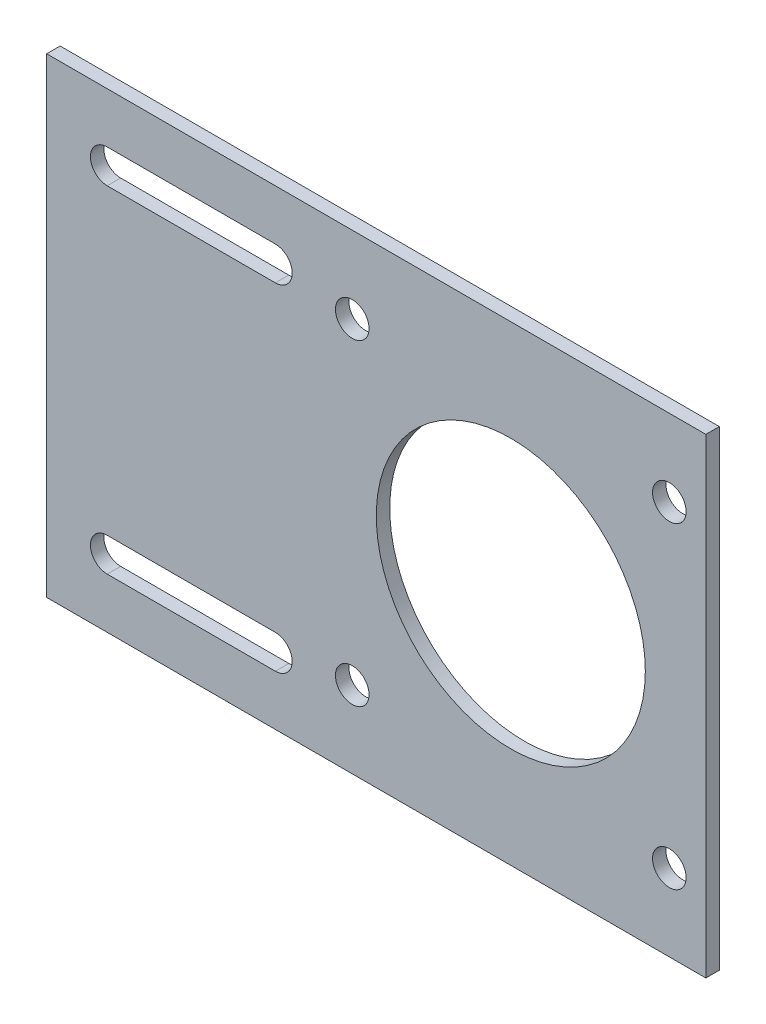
ISO-10303-21;
HEADER;
FILE_DESCRIPTION(('STEP AP214'),'2;1');
FILE_NAME('part.step','',(''),(''),'','','');
FILE_SCHEMA(('AUTOMOTIVE_DESIGN { 1 0 10303 214 1 1 1 1 }'));
ENDSEC;
DATA;
#1=APPLICATION_CONTEXT('core data for automotive mechanical design processes');
#2=APPLICATION_PROTOCOL_DEFINITION('international standard','automotive_design',2000,#1);
#3=PRODUCT_CONTEXT('',#1,'mechanical');
#4=PRODUCT('Part','Part','',(#3));
#5=PRODUCT_RELATED_PRODUCT_CATEGORY('part','',(#4));
#6=PRODUCT_DEFINITION_FORMATION('','',#4);
#7=PRODUCT_DEFINITION_CONTEXT('part definition',#1,'design');
#8=PRODUCT_DEFINITION('design','',#6,#7);
#9=PRODUCT_DEFINITION_SHAPE('','',#8);
#10=(LENGTH_UNIT() NAMED_UNIT(*) SI_UNIT(.MILLI.,.METRE.));
#11=(NAMED_UNIT(*) PLANE_ANGLE_UNIT() SI_UNIT($,.RADIAN.));
#12=(NAMED_UNIT(*) SI_UNIT($,.STERADIAN.) SOLID_ANGLE_UNIT());
#13=UNCERTAINTY_MEASURE_WITH_UNIT(LENGTH_MEASURE(1.E-05),#10,'distance_accuracy_value','');
#14=(GEOMETRIC_REPRESENTATION_CONTEXT(3) GLOBAL_UNCERTAINTY_ASSIGNED_CONTEXT((#13)) GLOBAL_UNIT_ASSIGNED_CONTEXT((#10,
#11,#12)) REPRESENTATION_CONTEXT('',''));
#15=CARTESIAN_POINT('',(0.,0.,0.));
#16=DIRECTION('',(0.,0.,1.));
#17=DIRECTION('',(1.,0.,0.));
#18=AXIS2_PLACEMENT_3D('',#15,#16,#17);
#19=CARTESIAN_POINT('',(-69.,-35.,2.));
#20=DIRECTION('',(0.,0.,1.));
#21=DIRECTION('',(1.,0.,0.));
#22=AXIS2_PLACEMENT_3D('',#19,#20,#21);
#23=PLANE('',#22);
#24=CARTESIAN_POINT('',(23.57,23.57,2.));
#25=DIRECTION('',(0.,0.,1.));
#26=DIRECTION('',(1.,0.,0.));
#27=AXIS2_PLACEMENT_3D('',#24,#25,#26);
#28=CIRCLE('',#27,2.5);
#29=CARTESIAN_POINT('',(26.07,23.57,2.));
#30=VERTEX_POINT('',#29);
#31=EDGE_CURVE('E403',#30,#30,#28,.T.);
#32=ORIENTED_EDGE('',*,*,#31,.F.);
#33=EDGE_LOOP('',(#32));
#34=FACE_BOUND('',#33,.T.);
#35=CARTESIAN_POINT('',(-23.57,23.57,2.));
#36=DIRECTION('',(0.,0.,1.));
#37=DIRECTION('',(1.,0.,0.));
#38=AXIS2_PLACEMENT_3D('',#35,#36,#37);
#39=CIRCLE('',#38,2.5);
#40=CARTESIAN_POINT('',(-21.07,23.57,2.));
#41=VERTEX_POINT('',#40);
#42=EDGE_CURVE('E405',#41,#41,#39,.T.);
#43=ORIENTED_EDGE('',*,*,#42,.F.);
#44=EDGE_LOOP('',(#43));
#45=FACE_BOUND('',#44,.T.);
#46=CARTESIAN_POINT('',(23.57,-23.57,2.));
#47=DIRECTION('',(0.,0.,1.));
#48=DIRECTION('',(1.,0.,0.));
#49=AXIS2_PLACEMENT_3D('',#46,#47,#48);
#50=CIRCLE('',#49,2.5);
#51=CARTESIAN_POINT('',(26.07,-23.57,2.));
#52=VERTEX_POINT('',#51);
#53=EDGE_CURVE('E413',#52,#52,#50,.T.);
#54=ORIENTED_EDGE('',*,*,#53,.F.);
#55=EDGE_LOOP('',(#54));
#56=FACE_BOUND('',#55,.T.);
#57=CARTESIAN_POINT('',(-23.57,-23.57,2.));
#58=DIRECTION('',(0.,0.,1.));
#59=DIRECTION('',(1.,0.,0.));
#60=AXIS2_PLACEMENT_3D('',#57,#58,#59);
#61=CIRCLE('',#60,2.5);
#62=CARTESIAN_POINT('',(-21.07,-23.57,2.));
#63=VERTEX_POINT('',#62);
#64=EDGE_CURVE('E419',#63,#63,#61,.T.);
#65=ORIENTED_EDGE('',*,*,#64,.F.);
#66=EDGE_LOOP('',(#65));
#67=FACE_BOUND('',#66,.T.);
#68=DIRECTION('',(1.,0.,0.));
#69=VECTOR('',#68,1.);
#70=CARTESIAN_POINT('',(-60.,22.5,2.));
#71=LINE('',#70,#69);
#72=CARTESIAN_POINT('',(-60.,22.5,2.));
#73=VERTEX_POINT('',#72);
#74=CARTESIAN_POINT('',(-35.,22.5,2.));
#75=VERTEX_POINT('',#74);
#76=EDGE_CURVE('E164',#73,#75,#71,.T.);
#77=ORIENTED_EDGE('',*,*,#76,.F.);
#78=CARTESIAN_POINT('',(-60.,25.,2.));
#79=DIRECTION('',(0.,0.,1.));
#80=DIRECTION('',(1.,0.,0.));
#81=AXIS2_PLACEMENT_3D('',#78,#79,#80);
#82=CIRCLE('',#81,2.5);
#83=CARTESIAN_POINT('',(-60.,27.5,2.));
#84=VERTEX_POINT('',#83);
#85=EDGE_CURVE('E162',#84,#73,#82,.T.);
#86=ORIENTED_EDGE('',*,*,#85,.F.);
#87=DIRECTION('',(-1.,0.,0.));
#88=VECTOR('',#87,1.);
#89=CARTESIAN_POINT('',(-60.,27.5,2.));
#90=LINE('',#89,#88);
#91=CARTESIAN_POINT('',(-35.,27.5,2.));
#92=VERTEX_POINT('',#91);
#93=EDGE_CURVE('E170',#92,#84,#90,.T.);
#94=ORIENTED_EDGE('',*,*,#93,.F.);
#95=CARTESIAN_POINT('',(-35.,25.,2.));
#96=DIRECTION('',(0.,0.,1.));
#97=DIRECTION('',(-1.,0.,0.));
#98=AXIS2_PLACEMENT_3D('',#95,#96,#97);
#99=CIRCLE('',#98,2.5);
#100=EDGE_CURVE('E167',#75,#92,#99,.T.);
#101=ORIENTED_EDGE('',*,*,#100,.F.);
#102=EDGE_LOOP('',(#77,#86,#94,#101));
#103=FACE_BOUND('',#102,.T.);
#104=DIRECTION('',(0.,-1.,0.));
#105=VECTOR('',#104,1.);
#106=CARTESIAN_POINT('',(-69.,35.,2.));
#107=LINE('',#106,#105);
#108=CARTESIAN_POINT('',(-69.,35.,2.));
#109=VERTEX_POINT('',#108);
#110=CARTESIAN_POINT('',(-69.,-35.,2.));
#111=VERTEX_POINT('',#110);
#112=EDGE_CURVE('E199',#109,#111,#107,.T.);
#113=ORIENTED_EDGE('',*,*,#112,.T.);
#114=DIRECTION('',(1.,0.,0.));
#115=VECTOR('',#114,1.);
#116=CARTESIAN_POINT('',(-69.,-35.,2.));
#117=LINE('',#116,#115);
#118=CARTESIAN_POINT('',(29.,-35.,2.));
#119=VERTEX_POINT('',#118);
#120=EDGE_CURVE('E202',#111,#119,#117,.T.);
#121=ORIENTED_EDGE('',*,*,#120,.T.);
#122=DIRECTION('',(0.,1.,0.));
#123=VECTOR('',#122,1.);
#124=CARTESIAN_POINT('',(29.,35.,2.));
#125=LINE('',#124,#123);
#126=CARTESIAN_POINT('',(29.,35.,2.));
#127=VERTEX_POINT('',#126);
#128=EDGE_CURVE('E205',#119,#127,#125,.T.);
#129=ORIENTED_EDGE('',*,*,#128,.T.);
#130=DIRECTION('',(-1.,0.,0.));
#131=VECTOR('',#130,1.);
#132=CARTESIAN_POINT('',(-69.,35.,2.));
#133=LINE('',#132,#131);
#134=EDGE_CURVE('E207',#127,#109,#133,.T.);
#135=ORIENTED_EDGE('',*,*,#134,.T.);
#136=EDGE_LOOP('',(#113,#121,#129,#135));
#137=FACE_BOUND('',#136,.T.);
#138=CARTESIAN_POINT('',(0.,0.,2.));
#139=DIRECTION('',(0.,0.,1.));
#140=DIRECTION('',(1.,0.,0.));
#141=AXIS2_PLACEMENT_3D('',#138,#139,#140);
#142=CIRCLE('',#141,20.);
#143=CARTESIAN_POINT('',(20.,0.,2.));
#144=VERTEX_POINT('',#143);
#145=EDGE_CURVE('E193',#144,#144,#142,.T.);
#146=ORIENTED_EDGE('',*,*,#145,.F.);
#147=EDGE_LOOP('',(#146));
#148=FACE_BOUND('',#147,.T.);
#149=DIRECTION('',(1.,0.,0.));
#150=VECTOR('',#149,1.);
#151=CARTESIAN_POINT('',(-60.,-27.5,2.));
#152=LINE('',#151,#150);
#153=CARTESIAN_POINT('',(-60.,-27.5,2.));
#154=VERTEX_POINT('',#153);
#155=CARTESIAN_POINT('',(-35.,-27.5,2.));
#156=VERTEX_POINT('',#155);
#157=EDGE_CURVE('E132',#154,#156,#152,.T.);
#158=ORIENTED_EDGE('',*,*,#157,.F.);
#159=CARTESIAN_POINT('',(-60.,-25.,2.));
#160=DIRECTION('',(0.,0.,1.));
#161=DIRECTION('',(1.,0.,0.));
#162=AXIS2_PLACEMENT_3D('',#159,#160,#161);
#163=CIRCLE('',#162,2.5);
#164=CARTESIAN_POINT('',(-60.,-22.5,2.));
#165=VERTEX_POINT('',#164);
#166=EDGE_CURVE('E124',#165,#154,#163,.T.);
#167=ORIENTED_EDGE('',*,*,#166,.F.);
#168=DIRECTION('',(-1.,0.,0.));
#169=VECTOR('',#168,1.);
#170=CARTESIAN_POINT('',(-60.,-22.5,2.));
#171=LINE('',#170,#169);
#172=CARTESIAN_POINT('',(-35.,-22.5,2.));
#173=VERTEX_POINT('',#172);
#174=EDGE_CURVE('E146',#173,#165,#171,.T.);
#175=ORIENTED_EDGE('',*,*,#174,.F.);
#176=CARTESIAN_POINT('',(-35.,-25.,2.));
#177=DIRECTION('',(0.,0.,1.));
#178=DIRECTION('',(-1.,0.,0.));
#179=AXIS2_PLACEMENT_3D('',#176,#177,#178);
#180=CIRCLE('',#179,2.5);
#181=EDGE_CURVE('E144',#156,#173,#180,.T.);
#182=ORIENTED_EDGE('',*,*,#181,.F.);
#183=EDGE_LOOP('',(#158,#167,#175,#182));
#184=FACE_BOUND('',#183,.T.);
#185=ADVANCED_FACE('F35',(#34,#45,#56,#67,#103,#137,#148,#184),#23,.T.);
#186=CARTESIAN_POINT('',(-69.,-35.,0.));
#187=DIRECTION('',(0.,0.,1.));
#188=DIRECTION('',(1.,0.,0.));
#189=AXIS2_PLACEMENT_3D('',#186,#187,#188);
#190=PLANE('',#189);
#191=CARTESIAN_POINT('',(23.57,23.57,0.));
#192=DIRECTION('',(0.,0.,1.));
#193=DIRECTION('',(1.,0.,0.));
#194=AXIS2_PLACEMENT_3D('',#191,#192,#193);
#195=CIRCLE('',#194,2.5);
#196=CARTESIAN_POINT('',(26.07,23.57,0.));
#197=VERTEX_POINT('',#196);
#198=EDGE_CURVE('E401',#197,#197,#195,.T.);
#199=ORIENTED_EDGE('',*,*,#198,.T.);
#200=EDGE_LOOP('',(#199));
#201=FACE_BOUND('',#200,.T.);
#202=CARTESIAN_POINT('',(-23.57,23.57,0.));
#203=DIRECTION('',(0.,0.,1.));
#204=DIRECTION('',(1.,0.,0.));
#205=AXIS2_PLACEMENT_3D('',#202,#203,#204);
#206=CIRCLE('',#205,2.5);
#207=CARTESIAN_POINT('',(-21.07,23.57,0.));
#208=VERTEX_POINT('',#207);
#209=EDGE_CURVE('E410',#208,#208,#206,.T.);
#210=ORIENTED_EDGE('',*,*,#209,.T.);
#211=EDGE_LOOP('',(#210));
#212=FACE_BOUND('',#211,.T.);
#213=CARTESIAN_POINT('',(23.57,-23.57,0.));
#214=DIRECTION('',(0.,0.,1.));
#215=DIRECTION('',(1.,0.,0.));
#216=AXIS2_PLACEMENT_3D('',#213,#214,#215);
#217=CIRCLE('',#216,2.5);
#218=CARTESIAN_POINT('',(26.07,-23.57,0.));
#219=VERTEX_POINT('',#218);
#220=EDGE_CURVE('E416',#219,#219,#217,.T.);
#221=ORIENTED_EDGE('',*,*,#220,.T.);
#222=EDGE_LOOP('',(#221));
#223=FACE_BOUND('',#222,.T.);
#224=CARTESIAN_POINT('',(-23.57,-23.57,0.));
#225=DIRECTION('',(0.,0.,1.));
#226=DIRECTION('',(1.,0.,0.));
#227=AXIS2_PLACEMENT_3D('',#224,#225,#226);
#228=CIRCLE('',#227,2.5);
#229=CARTESIAN_POINT('',(-21.07,-23.57,0.));
#230=VERTEX_POINT('',#229);
#231=EDGE_CURVE('E152',#230,#230,#228,.T.);
#232=ORIENTED_EDGE('',*,*,#231,.T.);
#233=EDGE_LOOP('',(#232));
#234=FACE_BOUND('',#233,.T.);
#235=CARTESIAN_POINT('',(-60.,25.,0.));
#236=DIRECTION('',(0.,0.,1.));
#237=DIRECTION('',(1.,0.,0.));
#238=AXIS2_PLACEMENT_3D('',#235,#236,#237);
#239=CIRCLE('',#238,2.5);
#240=CARTESIAN_POINT('',(-60.,27.5,0.));
#241=VERTEX_POINT('',#240);
#242=CARTESIAN_POINT('',(-60.,22.5,0.));
#243=VERTEX_POINT('',#242);
#244=EDGE_CURVE('E140',#241,#243,#239,.T.);
#245=ORIENTED_EDGE('',*,*,#244,.T.);
#246=DIRECTION('',(1.,0.,0.));
#247=VECTOR('',#246,1.);
#248=CARTESIAN_POINT('',(-60.,22.5,0.));
#249=LINE('',#248,#247);
#250=CARTESIAN_POINT('',(-35.,22.5,0.));
#251=VERTEX_POINT('',#250);
#252=EDGE_CURVE('E175',#243,#251,#249,.T.);
#253=ORIENTED_EDGE('',*,*,#252,.T.);
#254=CARTESIAN_POINT('',(-35.,25.,0.));
#255=DIRECTION('',(0.,0.,1.));
#256=DIRECTION('',(-1.,0.,0.));
#257=AXIS2_PLACEMENT_3D('',#254,#255,#256);
#258=CIRCLE('',#257,2.5);
#259=CARTESIAN_POINT('',(-35.,27.5,0.));
#260=VERTEX_POINT('',#259);
#261=EDGE_CURVE('E178',#251,#260,#258,.T.);
#262=ORIENTED_EDGE('',*,*,#261,.T.);
#263=DIRECTION('',(-1.,0.,0.));
#264=VECTOR('',#263,1.);
#265=CARTESIAN_POINT('',(-60.,27.5,0.));
#266=LINE('',#265,#264);
#267=EDGE_CURVE('E165',#260,#241,#266,.T.);
#268=ORIENTED_EDGE('',*,*,#267,.T.);
#269=EDGE_LOOP('',(#245,#253,#262,#268));
#270=FACE_BOUND('',#269,.T.);
#271=DIRECTION('',(0.,-1.,0.));
#272=VECTOR('',#271,1.);
#273=CARTESIAN_POINT('',(-69.,35.,0.));
#274=LINE('',#273,#272);
#275=CARTESIAN_POINT('',(-69.,35.,0.));
#276=VERTEX_POINT('',#275);
#277=CARTESIAN_POINT('',(-69.,-35.,0.));
#278=VERTEX_POINT('',#277);
#279=EDGE_CURVE('E196',#276,#278,#274,.T.);
#280=ORIENTED_EDGE('',*,*,#279,.F.);
#281=DIRECTION('',(-1.,0.,0.));
#282=VECTOR('',#281,1.);
#283=CARTESIAN_POINT('',(-69.,35.,0.));
#284=LINE('',#283,#282);
#285=CARTESIAN_POINT('',(29.,35.,0.));
#286=VERTEX_POINT('',#285);
#287=EDGE_CURVE('E203',#286,#276,#284,.T.);
#288=ORIENTED_EDGE('',*,*,#287,.F.);
#289=DIRECTION('',(0.,1.,0.));
#290=VECTOR('',#289,1.);
#291=CARTESIAN_POINT('',(29.,35.,0.));
#292=LINE('',#291,#290);
#293=CARTESIAN_POINT('',(29.,-35.,0.));
#294=VERTEX_POINT('',#293);
#295=EDGE_CURVE('E214',#294,#286,#292,.T.);
#296=ORIENTED_EDGE('',*,*,#295,.F.);
#297=DIRECTION('',(1.,0.,0.));
#298=VECTOR('',#297,1.);
#299=CARTESIAN_POINT('',(-69.,-35.,0.));
#300=LINE('',#299,#298);
#301=EDGE_CURVE('E212',#278,#294,#300,.T.);
#302=ORIENTED_EDGE('',*,*,#301,.F.);
#303=EDGE_LOOP('',(#280,#288,#296,#302));
#304=FACE_BOUND('',#303,.T.);
#305=CARTESIAN_POINT('',(0.,0.,0.));
#306=DIRECTION('',(0.,0.,1.));
#307=DIRECTION('',(1.,0.,0.));
#308=AXIS2_PLACEMENT_3D('',#305,#306,#307);
#309=CIRCLE('',#308,20.);
#310=CARTESIAN_POINT('',(20.,0.,0.));
#311=VERTEX_POINT('',#310);
#312=EDGE_CURVE('E192',#311,#311,#309,.T.);
#313=ORIENTED_EDGE('',*,*,#312,.T.);
#314=EDGE_LOOP('',(#313));
#315=FACE_BOUND('',#314,.T.);
#316=CARTESIAN_POINT('',(-60.,-25.,0.));
#317=DIRECTION('',(0.,0.,1.));
#318=DIRECTION('',(1.,0.,0.));
#319=AXIS2_PLACEMENT_3D('',#316,#317,#318);
#320=CIRCLE('',#319,2.5);
#321=CARTESIAN_POINT('',(-60.,-22.5,0.));
#322=VERTEX_POINT('',#321);
#323=CARTESIAN_POINT('',(-60.,-27.5,0.));
#324=VERTEX_POINT('',#323);
#325=EDGE_CURVE('E58',#322,#324,#320,.T.);
#326=ORIENTED_EDGE('',*,*,#325,.T.);
#327=DIRECTION('',(1.,0.,0.));
#328=VECTOR('',#327,1.);
#329=CARTESIAN_POINT('',(-60.,-27.5,0.));
#330=LINE('',#329,#328);
#331=CARTESIAN_POINT('',(-35.,-27.5,0.));
#332=VERTEX_POINT('',#331);
#333=EDGE_CURVE('E139',#324,#332,#330,.T.);
#334=ORIENTED_EDGE('',*,*,#333,.T.);
#335=CARTESIAN_POINT('',(-35.,-25.,0.));
#336=DIRECTION('',(0.,0.,1.));
#337=DIRECTION('',(-1.,0.,0.));
#338=AXIS2_PLACEMENT_3D('',#335,#336,#337);
#339=CIRCLE('',#338,2.5);
#340=CARTESIAN_POINT('',(-35.,-22.5,0.));
#341=VERTEX_POINT('',#340);
#342=EDGE_CURVE('E154',#332,#341,#339,.T.);
#343=ORIENTED_EDGE('',*,*,#342,.T.);
#344=DIRECTION('',(-1.,0.,0.));
#345=VECTOR('',#344,1.);
#346=CARTESIAN_POINT('',(-60.,-22.5,0.));
#347=LINE('',#346,#345);
#348=EDGE_CURVE('E133',#341,#322,#347,.T.);
#349=ORIENTED_EDGE('',*,*,#348,.T.);
#350=EDGE_LOOP('',(#326,#334,#343,#349));
#351=FACE_BOUND('',#350,.T.);
#352=ADVANCED_FACE('F232',(#201,#212,#223,#234,#270,#304,#315,#351),#190,.F.);
#353=CARTESIAN_POINT('',(-69.,35.,2.));
#354=DIRECTION('',(1.,0.,0.));
#355=DIRECTION('',(0.,1.,0.));
#356=AXIS2_PLACEMENT_3D('',#353,#354,#355);
#357=PLANE('',#356);
#358=ORIENTED_EDGE('',*,*,#279,.T.);
#359=DIRECTION('',(0.,0.,-1.));
#360=VECTOR('',#359,1.);
#361=CARTESIAN_POINT('',(-69.,-35.,2.));
#362=LINE('',#361,#360);
#363=EDGE_CURVE('E11',#111,#278,#362,.T.);
#364=ORIENTED_EDGE('',*,*,#363,.F.);
#365=ORIENTED_EDGE('',*,*,#112,.F.);
#366=DIRECTION('',(0.,0.,-1.));
#367=VECTOR('',#366,1.);
#368=CARTESIAN_POINT('',(-69.,35.,2.));
#369=LINE('',#368,#367);
#370=EDGE_CURVE('E209',#109,#276,#369,.T.);
#371=ORIENTED_EDGE('',*,*,#370,.T.);
#372=EDGE_LOOP('',(#358,#364,#365,#371));
#373=FACE_BOUND('',#372,.T.);
#374=ADVANCED_FACE('F37',(#373),#357,.F.);
#375=CARTESIAN_POINT('',(-69.,-35.,2.));
#376=DIRECTION('',(0.,1.,0.));
#377=DIRECTION('',(0.,0.,1.));
#378=AXIS2_PLACEMENT_3D('',#375,#376,#377);
#379=PLANE('',#378);
#380=ORIENTED_EDGE('',*,*,#301,.T.);
#381=DIRECTION('',(0.,0.,-1.));
#382=VECTOR('',#381,1.);
#383=CARTESIAN_POINT('',(29.,-35.,2.));
#384=LINE('',#383,#382);
#385=EDGE_CURVE('E43',#119,#294,#384,.T.);
#386=ORIENTED_EDGE('',*,*,#385,.F.);
#387=ORIENTED_EDGE('',*,*,#120,.F.);
#388=ORIENTED_EDGE('',*,*,#363,.T.);
#389=EDGE_LOOP('',(#380,#386,#387,#388));
#390=FACE_BOUND('',#389,.T.);
#391=ADVANCED_FACE('F243',(#390),#379,.F.);
#392=CARTESIAN_POINT('',(29.,35.,2.));
#393=DIRECTION('',(-1.,0.,0.));
#394=DIRECTION('',(0.,-1.,0.));
#395=AXIS2_PLACEMENT_3D('',#392,#393,#394);
#396=PLANE('',#395);
#397=ORIENTED_EDGE('',*,*,#295,.T.);
#398=DIRECTION('',(0.,0.,-1.));
#399=VECTOR('',#398,1.);
#400=CARTESIAN_POINT('',(29.,35.,2.));
#401=LINE('',#400,#399);
#402=EDGE_CURVE('E219',#127,#286,#401,.T.);
#403=ORIENTED_EDGE('',*,*,#402,.F.);
#404=ORIENTED_EDGE('',*,*,#128,.F.);
#405=ORIENTED_EDGE('',*,*,#385,.T.);
#406=EDGE_LOOP('',(#397,#403,#404,#405));
#407=FACE_BOUND('',#406,.T.);
#408=ADVANCED_FACE('F226',(#407),#396,.F.);
#409=CARTESIAN_POINT('',(-69.,35.,2.));
#410=DIRECTION('',(0.,-1.,0.));
#411=DIRECTION('',(0.,0.,-1.));
#412=AXIS2_PLACEMENT_3D('',#409,#410,#411);
#413=PLANE('',#412);
#414=ORIENTED_EDGE('',*,*,#287,.T.);
#415=ORIENTED_EDGE('',*,*,#370,.F.);
#416=ORIENTED_EDGE('',*,*,#134,.F.);
#417=ORIENTED_EDGE('',*,*,#402,.T.);
#418=EDGE_LOOP('',(#414,#415,#416,#417));
#419=FACE_BOUND('',#418,.T.);
#420=ADVANCED_FACE('F236',(#419),#413,.F.);
#421=CARTESIAN_POINT('',(0.,0.,2.));
#422=DIRECTION('',(0.,0.,-1.));
#423=DIRECTION('',(-1.,0.,0.));
#424=AXIS2_PLACEMENT_3D('',#421,#422,#423);
#425=CYLINDRICAL_SURFACE('',#424,20.);
#426=ORIENTED_EDGE('',*,*,#145,.T.);
#427=EDGE_LOOP('',(#426));
#428=FACE_BOUND('',#427,.T.);
#429=ORIENTED_EDGE('',*,*,#312,.F.);
#430=EDGE_LOOP('',(#429));
#431=FACE_BOUND('',#430,.T.);
#432=ADVANCED_FACE('F261',(#428,#431),#425,.F.);
#433=CARTESIAN_POINT('',(-60.,25.,2.));
#434=DIRECTION('',(0.,0.,-1.));
#435=DIRECTION('',(-1.,0.,0.));
#436=AXIS2_PLACEMENT_3D('',#433,#434,#435);
#437=CYLINDRICAL_SURFACE('',#436,2.5);
#438=ORIENTED_EDGE('',*,*,#244,.F.);
#439=DIRECTION('',(0.,0.,-1.));
#440=VECTOR('',#439,1.);
#441=CARTESIAN_POINT('',(-60.,27.5,2.));
#442=LINE('',#441,#440);
#443=EDGE_CURVE('E172',#84,#241,#442,.T.);
#444=ORIENTED_EDGE('',*,*,#443,.F.);
#445=ORIENTED_EDGE('',*,*,#85,.T.);
#446=DIRECTION('',(0.,0.,-1.));
#447=VECTOR('',#446,1.);
#448=CARTESIAN_POINT('',(-60.,22.5,2.));
#449=LINE('',#448,#447);
#450=EDGE_CURVE('E189',#73,#243,#449,.T.);
#451=ORIENTED_EDGE('',*,*,#450,.T.);
#452=EDGE_LOOP('',(#438,#444,#445,#451));
#453=FACE_BOUND('',#452,.T.);
#454=ADVANCED_FACE('F268',(#453),#437,.F.);
#455=CARTESIAN_POINT('',(-60.,22.5,2.));
#456=DIRECTION('',(0.,1.,0.));
#457=DIRECTION('',(0.,0.,1.));
#458=AXIS2_PLACEMENT_3D('',#455,#456,#457);
#459=PLANE('',#458);
#460=ORIENTED_EDGE('',*,*,#252,.F.);
#461=ORIENTED_EDGE('',*,*,#450,.F.);
#462=ORIENTED_EDGE('',*,*,#76,.T.);
#463=DIRECTION('',(0.,0.,-1.));
#464=VECTOR('',#463,1.);
#465=CARTESIAN_POINT('',(-35.,22.5,2.));
#466=LINE('',#465,#464);
#467=EDGE_CURVE('E187',#75,#251,#466,.T.);
#468=ORIENTED_EDGE('',*,*,#467,.T.);
#469=EDGE_LOOP('',(#460,#461,#462,#468));
#470=FACE_BOUND('',#469,.T.);
#471=ADVANCED_FACE('F273',(#470),#459,.T.);
#472=CARTESIAN_POINT('',(-35.,25.,2.));
#473=DIRECTION('',(0.,0.,-1.));
#474=DIRECTION('',(-1.,0.,0.));
#475=AXIS2_PLACEMENT_3D('',#472,#473,#474);
#476=CYLINDRICAL_SURFACE('',#475,2.5);
#477=ORIENTED_EDGE('',*,*,#261,.F.);
#478=ORIENTED_EDGE('',*,*,#467,.F.);
#479=ORIENTED_EDGE('',*,*,#100,.T.);
#480=DIRECTION('',(0.,0.,-1.));
#481=VECTOR('',#480,1.);
#482=CARTESIAN_POINT('',(-35.,27.5,2.));
#483=LINE('',#482,#481);
#484=EDGE_CURVE('E185',#92,#260,#483,.T.);
#485=ORIENTED_EDGE('',*,*,#484,.T.);
#486=EDGE_LOOP('',(#477,#478,#479,#485));
#487=FACE_BOUND('',#486,.T.);
#488=ADVANCED_FACE('F303',(#487),#476,.F.);
#489=CARTESIAN_POINT('',(-60.,27.5,2.));
#490=DIRECTION('',(0.,-1.,0.));
#491=DIRECTION('',(0.,0.,-1.));
#492=AXIS2_PLACEMENT_3D('',#489,#490,#491);
#493=PLANE('',#492);
#494=ORIENTED_EDGE('',*,*,#267,.F.);
#495=ORIENTED_EDGE('',*,*,#484,.F.);
#496=ORIENTED_EDGE('',*,*,#93,.T.);
#497=ORIENTED_EDGE('',*,*,#443,.T.);
#498=EDGE_LOOP('',(#494,#495,#496,#497));
#499=FACE_BOUND('',#498,.T.);
#500=ADVANCED_FACE('F300',(#499),#493,.T.);
#501=CARTESIAN_POINT('',(-60.,-25.,2.));
#502=DIRECTION('',(0.,0.,-1.));
#503=DIRECTION('',(-1.,0.,0.));
#504=AXIS2_PLACEMENT_3D('',#501,#502,#503);
#505=CYLINDRICAL_SURFACE('',#504,2.5);
#506=ORIENTED_EDGE('',*,*,#325,.F.);
#507=DIRECTION('',(0.,0.,-1.));
#508=VECTOR('',#507,1.);
#509=CARTESIAN_POINT('',(-60.,-22.5,2.));
#510=LINE('',#509,#508);
#511=EDGE_CURVE('E128',#165,#322,#510,.T.);
#512=ORIENTED_EDGE('',*,*,#511,.F.);
#513=ORIENTED_EDGE('',*,*,#166,.T.);
#514=DIRECTION('',(0.,0.,-1.));
#515=VECTOR('',#514,1.);
#516=CARTESIAN_POINT('',(-60.,-27.5,2.));
#517=LINE('',#516,#515);
#518=EDGE_CURVE('E127',#154,#324,#517,.T.);
#519=ORIENTED_EDGE('',*,*,#518,.T.);
#520=EDGE_LOOP('',(#506,#512,#513,#519));
#521=FACE_BOUND('',#520,.T.);
#522=ADVANCED_FACE('F126',(#521),#505,.F.);
#523=CARTESIAN_POINT('',(-60.,-27.5,2.));
#524=DIRECTION('',(0.,1.,0.));
#525=DIRECTION('',(0.,0.,1.));
#526=AXIS2_PLACEMENT_3D('',#523,#524,#525);
#527=PLANE('',#526);
#528=ORIENTED_EDGE('',*,*,#333,.F.);
#529=ORIENTED_EDGE('',*,*,#518,.F.);
#530=ORIENTED_EDGE('',*,*,#157,.T.);
#531=DIRECTION('',(0.,0.,-1.));
#532=VECTOR('',#531,1.);
#533=CARTESIAN_POINT('',(-35.,-27.5,2.));
#534=LINE('',#533,#532);
#535=EDGE_CURVE('E141',#156,#332,#534,.T.);
#536=ORIENTED_EDGE('',*,*,#535,.T.);
#537=EDGE_LOOP('',(#528,#529,#530,#536));
#538=FACE_BOUND('',#537,.T.);
#539=ADVANCED_FACE('F136',(#538),#527,.T.);
#540=CARTESIAN_POINT('',(-35.,-25.,2.));
#541=DIRECTION('',(0.,0.,-1.));
#542=DIRECTION('',(-1.,0.,0.));
#543=AXIS2_PLACEMENT_3D('',#540,#541,#542);
#544=CYLINDRICAL_SURFACE('',#543,2.5);
#545=ORIENTED_EDGE('',*,*,#342,.F.);
#546=ORIENTED_EDGE('',*,*,#535,.F.);
#547=ORIENTED_EDGE('',*,*,#181,.T.);
#548=DIRECTION('',(0.,0.,-1.));
#549=VECTOR('',#548,1.);
#550=CARTESIAN_POINT('',(-35.,-22.5,2.));
#551=LINE('',#550,#549);
#552=EDGE_CURVE('E50',#173,#341,#551,.T.);
#553=ORIENTED_EDGE('',*,*,#552,.T.);
#554=EDGE_LOOP('',(#545,#546,#547,#553));
#555=FACE_BOUND('',#554,.T.);
#556=ADVANCED_FACE('F283',(#555),#544,.F.);
#557=CARTESIAN_POINT('',(-60.,-22.5,2.));
#558=DIRECTION('',(0.,-1.,0.));
#559=DIRECTION('',(0.,0.,-1.));
#560=AXIS2_PLACEMENT_3D('',#557,#558,#559);
#561=PLANE('',#560);
#562=ORIENTED_EDGE('',*,*,#348,.F.);
#563=ORIENTED_EDGE('',*,*,#552,.F.);
#564=ORIENTED_EDGE('',*,*,#174,.T.);
#565=ORIENTED_EDGE('',*,*,#511,.T.);
#566=EDGE_LOOP('',(#562,#563,#564,#565));
#567=FACE_BOUND('',#566,.T.);
#568=ADVANCED_FACE('F280',(#567),#561,.T.);
#569=CARTESIAN_POINT('',(-23.57,-23.57,2.));
#570=DIRECTION('',(0.,0.,1.));
#571=DIRECTION('',(1.,0.,0.));
#572=AXIS2_PLACEMENT_3D('',#569,#570,#571);
#573=CYLINDRICAL_SURFACE('',#572,2.5);
#574=ORIENTED_EDGE('',*,*,#231,.F.);
#575=EDGE_LOOP('',(#574));
#576=FACE_BOUND('',#575,.T.);
#577=ORIENTED_EDGE('',*,*,#64,.T.);
#578=EDGE_LOOP('',(#577));
#579=FACE_BOUND('',#578,.T.);
#580=ADVANCED_FACE('F282',(#576,#579),#573,.F.);
#581=CARTESIAN_POINT('',(23.57,-23.57,2.));
#582=DIRECTION('',(0.,0.,1.));
#583=DIRECTION('',(1.,0.,0.));
#584=AXIS2_PLACEMENT_3D('',#581,#582,#583);
#585=CYLINDRICAL_SURFACE('',#584,2.5);
#586=ORIENTED_EDGE('',*,*,#220,.F.);
#587=EDGE_LOOP('',(#586));
#588=FACE_BOUND('',#587,.T.);
#589=ORIENTED_EDGE('',*,*,#53,.T.);
#590=EDGE_LOOP('',(#589));
#591=FACE_BOUND('',#590,.T.);
#592=ADVANCED_FACE('F289',(#588,#591),#585,.F.);
#593=CARTESIAN_POINT('',(-23.57,23.57,2.));
#594=DIRECTION('',(0.,0.,1.));
#595=DIRECTION('',(1.,0.,0.));
#596=AXIS2_PLACEMENT_3D('',#593,#594,#595);
#597=CYLINDRICAL_SURFACE('',#596,2.5);
#598=ORIENTED_EDGE('',*,*,#209,.F.);
#599=EDGE_LOOP('',(#598));
#600=FACE_BOUND('',#599,.T.);
#601=ORIENTED_EDGE('',*,*,#42,.T.);
#602=EDGE_LOOP('',(#601));
#603=FACE_BOUND('',#602,.T.);
#604=ADVANCED_FACE('F375',(#600,#603),#597,.F.);
#605=CARTESIAN_POINT('',(23.57,23.57,2.));
#606=DIRECTION('',(0.,0.,1.));
#607=DIRECTION('',(1.,0.,0.));
#608=AXIS2_PLACEMENT_3D('',#605,#606,#607);
#609=CYLINDRICAL_SURFACE('',#608,2.5);
#610=ORIENTED_EDGE('',*,*,#198,.F.);
#611=EDGE_LOOP('',(#610));
#612=FACE_BOUND('',#611,.T.);
#613=ORIENTED_EDGE('',*,*,#31,.T.);
#614=EDGE_LOOP('',(#613));
#615=FACE_BOUND('',#614,.T.);
#616=ADVANCED_FACE('F384',(#612,#615),#609,.F.);
#617=CLOSED_SHELL('',(#185,#352,#374,#391,#408,#420,#432,#454,#471,#488,#500,#522,#539,#556,
#568,#580,#592,#604,#616));
#618=MANIFOLD_SOLID_BREP('B2',#617);
#619=ADVANCED_BREP_SHAPE_REPRESENTATION('',(#18,#618),#14);
#620=SHAPE_DEFINITION_REPRESENTATION(#9,#619);
ENDSEC;
END-ISO-10303-21;
